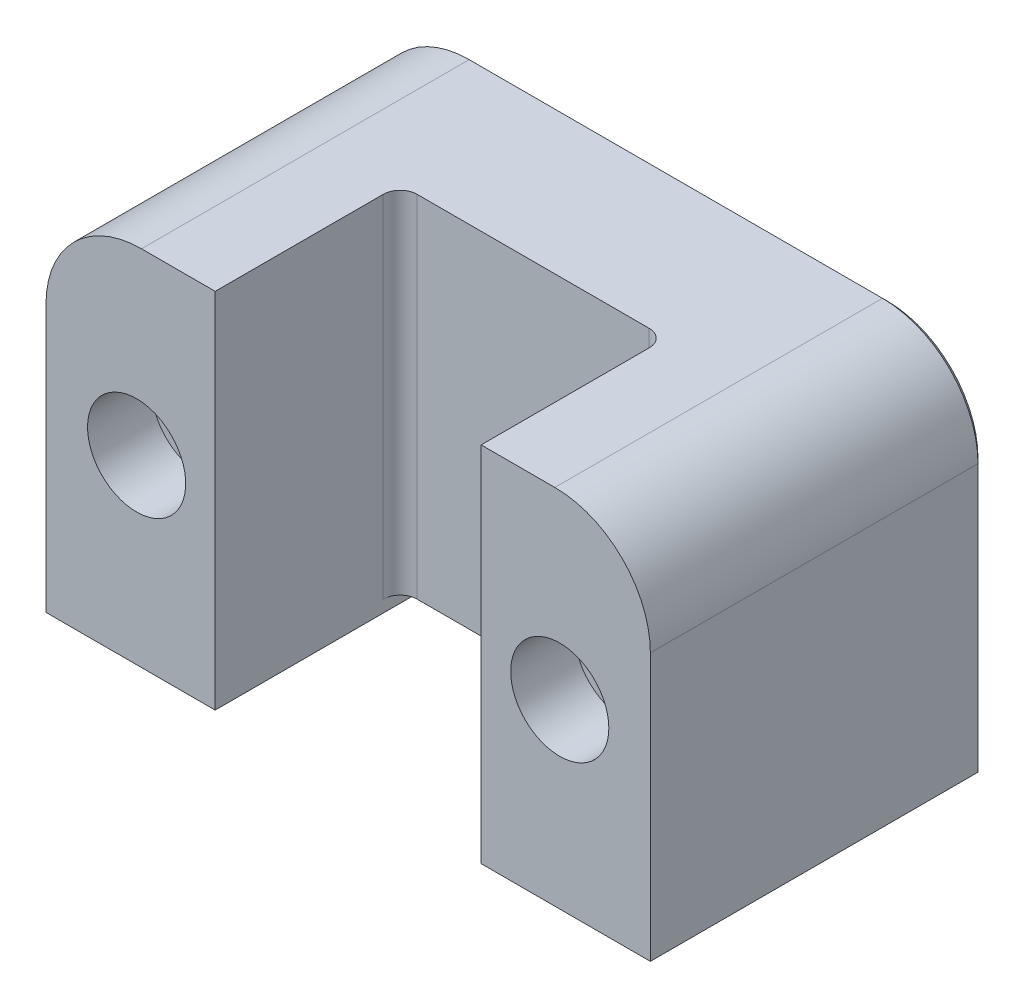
ISO-10303-21;
HEADER;
FILE_DESCRIPTION(('STEP AP214'),'2;1');
FILE_NAME('part.step','',(''),(''),'','','');
FILE_SCHEMA(('AUTOMOTIVE_DESIGN { 1 0 10303 214 1 1 1 1 }'));
ENDSEC;
DATA;
#1=APPLICATION_CONTEXT('core data for automotive mechanical design processes');
#2=APPLICATION_PROTOCOL_DEFINITION('international standard','automotive_design',2000,#1);
#3=PRODUCT_CONTEXT('',#1,'mechanical');
#4=PRODUCT('Part','Part','',(#3));
#5=PRODUCT_RELATED_PRODUCT_CATEGORY('part','',(#4));
#6=PRODUCT_DEFINITION_FORMATION('','',#4);
#7=PRODUCT_DEFINITION_CONTEXT('part definition',#1,'design');
#8=PRODUCT_DEFINITION('design','',#6,#7);
#9=PRODUCT_DEFINITION_SHAPE('','',#8);
#10=(LENGTH_UNIT() NAMED_UNIT(*) SI_UNIT(.MILLI.,.METRE.));
#11=(NAMED_UNIT(*) PLANE_ANGLE_UNIT() SI_UNIT($,.RADIAN.));
#12=(NAMED_UNIT(*) SI_UNIT($,.STERADIAN.) SOLID_ANGLE_UNIT());
#13=UNCERTAINTY_MEASURE_WITH_UNIT(LENGTH_MEASURE(1.E-05),#10,'distance_accuracy_value','');
#14=(GEOMETRIC_REPRESENTATION_CONTEXT(3) GLOBAL_UNCERTAINTY_ASSIGNED_CONTEXT((#13)) GLOBAL_UNIT_ASSIGNED_CONTEXT((#10,
#11,#12)) REPRESENTATION_CONTEXT('',''));
#15=CARTESIAN_POINT('',(0.,0.,0.));
#16=DIRECTION('',(0.,0.,1.));
#17=DIRECTION('',(1.,0.,0.));
#18=AXIS2_PLACEMENT_3D('',#15,#16,#17);
#19=CARTESIAN_POINT('',(-31.74365,38.1,-34.925));
#20=DIRECTION('',(0.,0.,1.));
#21=DIRECTION('',(1.,0.,0.));
#22=AXIS2_PLACEMENT_3D('',#19,#20,#21);
#23=PLANE('',#22);
#24=CARTESIAN_POINT('',(-22.225,19.05,-34.925));
#25=DIRECTION('',(0.,0.,-1.));
#26=DIRECTION('',(-1.,0.,0.));
#27=AXIS2_PLACEMENT_3D('',#24,#25,#26);
#28=CIRCLE('',#27,3.56870000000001);
#29=CARTESIAN_POINT('',(-25.7937,19.05,-34.925));
#30=VERTEX_POINT('',#29);
#31=EDGE_CURVE('E322',#30,#30,#28,.T.);
#32=ORIENTED_EDGE('',*,*,#31,.F.);
#33=EDGE_LOOP('',(#32));
#34=FACE_BOUND('',#33,.T.);
#35=CARTESIAN_POINT('',(21.71065,28.067,-34.925));
#36=DIRECTION('',(0.,0.,1.));
#37=DIRECTION('',(1.,0.,0.));
#38=AXIS2_PLACEMENT_3D('',#35,#36,#37);
#39=CIRCLE('',#38,9.52499999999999);
#40=CARTESIAN_POINT('',(21.71065,37.592,-34.925));
#41=VERTEX_POINT('',#40);
#42=CARTESIAN_POINT('',(31.23565,28.067,-34.925));
#43=VERTEX_POINT('',#42);
#44=EDGE_CURVE('E275',#41,#43,#39,.F.);
#45=ORIENTED_EDGE('',*,*,#44,.T.);
#46=DIRECTION('',(0.,-1.,0.));
#47=VECTOR('',#46,1.);
#48=CARTESIAN_POINT('',(31.23565,38.1,-34.925));
#49=LINE('',#48,#47);
#50=CARTESIAN_POINT('',(31.23565,0.,-34.925));
#51=VERTEX_POINT('',#50);
#52=EDGE_CURVE('E279',#43,#51,#49,.T.);
#53=ORIENTED_EDGE('',*,*,#52,.T.);
#54=DIRECTION('',(-1.,0.,0.));
#55=VECTOR('',#54,1.);
#56=CARTESIAN_POINT('',(-31.74365,0.,-34.925));
#57=LINE('',#56,#55);
#58=CARTESIAN_POINT('',(-31.23565,0.,-34.925));
#59=VERTEX_POINT('',#58);
#60=EDGE_CURVE('E173',#51,#59,#57,.T.);
#61=ORIENTED_EDGE('',*,*,#60,.T.);
#62=DIRECTION('',(0.,1.,0.));
#63=VECTOR('',#62,1.);
#64=CARTESIAN_POINT('',(-31.23565,38.1,-34.925));
#65=LINE('',#64,#63);
#66=CARTESIAN_POINT('',(-31.23565,28.067,-34.925));
#67=VERTEX_POINT('',#66);
#68=EDGE_CURVE('E277',#59,#67,#65,.T.);
#69=ORIENTED_EDGE('',*,*,#68,.T.);
#70=CARTESIAN_POINT('',(-21.71065,28.067,-34.925));
#71=DIRECTION('',(0.,0.,1.));
#72=DIRECTION('',(1.,0.,0.));
#73=AXIS2_PLACEMENT_3D('',#70,#71,#72);
#74=CIRCLE('',#73,9.52499999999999);
#75=CARTESIAN_POINT('',(-21.71065,37.592,-34.925));
#76=VERTEX_POINT('',#75);
#77=EDGE_CURVE('E273',#67,#76,#74,.F.);
#78=ORIENTED_EDGE('',*,*,#77,.T.);
#79=DIRECTION('',(1.,0.,0.));
#80=VECTOR('',#79,1.);
#81=CARTESIAN_POINT('',(-31.74365,37.592,-34.925));
#82=LINE('',#81,#80);
#83=EDGE_CURVE('E271',#76,#41,#82,.T.);
#84=ORIENTED_EDGE('',*,*,#83,.T.);
#85=EDGE_LOOP('',(#45,#53,#61,#69,#78,#84));
#86=FACE_BOUND('',#85,.T.);
#87=CARTESIAN_POINT('',(22.225,19.05,-34.925));
#88=DIRECTION('',(0.,0.,1.));
#89=DIRECTION('',(1.,0.,0.));
#90=AXIS2_PLACEMENT_3D('',#87,#88,#89);
#91=CIRCLE('',#90,3.56870000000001);
#92=CARTESIAN_POINT('',(25.7937,19.05,-34.925));
#93=VERTEX_POINT('',#92);
#94=EDGE_CURVE('E303',#93,#93,#91,.T.);
#95=ORIENTED_EDGE('',*,*,#94,.T.);
#96=EDGE_LOOP('',(#95));
#97=FACE_BOUND('',#96,.T.);
#98=ADVANCED_FACE('F32',(#34,#86,#97),#23,.F.);
#99=CARTESIAN_POINT('',(13.97,38.1,0.));
#100=DIRECTION('',(0.,0.,-1.));
#101=DIRECTION('',(-1.,0.,0.));
#102=AXIS2_PLACEMENT_3D('',#99,#100,#101);
#103=PLANE('',#102);
#104=DIRECTION('',(0.,-1.,0.));
#105=VECTOR('',#104,1.);
#106=CARTESIAN_POINT('',(31.74365,38.1,0.));
#107=LINE('',#106,#105);
#108=CARTESIAN_POINT('',(31.74365,28.067,0.));
#109=VERTEX_POINT('',#108);
#110=CARTESIAN_POINT('',(31.74365,0.,0.));
#111=VERTEX_POINT('',#110);
#112=EDGE_CURVE('E202',#109,#111,#107,.T.);
#113=ORIENTED_EDGE('',*,*,#112,.F.);
#114=CARTESIAN_POINT('',(21.71065,28.067,0.));
#115=DIRECTION('',(0.,0.,-1.));
#116=DIRECTION('',(-1.,0.,0.));
#117=AXIS2_PLACEMENT_3D('',#114,#115,#116);
#118=CIRCLE('',#117,10.033);
#119=CARTESIAN_POINT('',(21.71065,38.1,0.));
#120=VERTEX_POINT('',#119);
#121=EDGE_CURVE('E264',#109,#120,#118,.F.);
#122=ORIENTED_EDGE('',*,*,#121,.T.);
#123=DIRECTION('',(1.,0.,0.));
#124=VECTOR('',#123,1.);
#125=CARTESIAN_POINT('',(13.97,38.1,0.));
#126=LINE('',#125,#124);
#127=CARTESIAN_POINT('',(13.97,38.1,0.));
#128=VERTEX_POINT('',#127);
#129=EDGE_CURVE('E199',#128,#120,#126,.T.);
#130=ORIENTED_EDGE('',*,*,#129,.F.);
#131=DIRECTION('',(0.,-1.,0.));
#132=VECTOR('',#131,1.);
#133=CARTESIAN_POINT('',(13.97,38.1,0.));
#134=LINE('',#133,#132);
#135=CARTESIAN_POINT('',(13.97,0.,0.));
#136=VERTEX_POINT('',#135);
#137=EDGE_CURVE('E186',#128,#136,#134,.T.);
#138=ORIENTED_EDGE('',*,*,#137,.T.);
#139=DIRECTION('',(1.,0.,0.));
#140=VECTOR('',#139,1.);
#141=CARTESIAN_POINT('',(13.97,0.,0.));
#142=LINE('',#141,#140);
#143=EDGE_CURVE('E211',#136,#111,#142,.T.);
#144=ORIENTED_EDGE('',*,*,#143,.T.);
#145=EDGE_LOOP('',(#113,#122,#130,#138,#144));
#146=FACE_BOUND('',#145,.T.);
#147=CARTESIAN_POINT('',(22.225,19.05,0.));
#148=DIRECTION('',(0.,0.,1.));
#149=DIRECTION('',(1.,0.,0.));
#150=AXIS2_PLACEMENT_3D('',#147,#148,#149);
#151=CIRCLE('',#150,5.1562);
#152=CARTESIAN_POINT('',(27.3812,19.05,0.));
#153=VERTEX_POINT('',#152);
#154=EDGE_CURVE('E319',#153,#153,#151,.T.);
#155=ORIENTED_EDGE('',*,*,#154,.F.);
#156=EDGE_LOOP('',(#155));
#157=FACE_BOUND('',#156,.T.);
#158=ADVANCED_FACE('F367',(#146,#157),#103,.F.);
#159=CARTESIAN_POINT('',(-31.74365,38.1,0.));
#160=DIRECTION('',(0.,0.,-1.));
#161=DIRECTION('',(-1.,0.,0.));
#162=AXIS2_PLACEMENT_3D('',#159,#160,#161);
#163=PLANE('',#162);
#164=DIRECTION('',(1.,0.,0.));
#165=VECTOR('',#164,1.);
#166=CARTESIAN_POINT('',(-31.74365,38.1,0.));
#167=LINE('',#166,#165);
#168=CARTESIAN_POINT('',(-21.71065,38.1,0.));
#169=VERTEX_POINT('',#168);
#170=CARTESIAN_POINT('',(-13.97,38.1,0.));
#171=VERTEX_POINT('',#170);
#172=EDGE_CURVE('E164',#169,#171,#167,.T.);
#173=ORIENTED_EDGE('',*,*,#172,.F.);
#174=CARTESIAN_POINT('',(-21.71065,28.067,0.));
#175=DIRECTION('',(0.,0.,-1.));
#176=DIRECTION('',(-1.,0.,0.));
#177=AXIS2_PLACEMENT_3D('',#174,#175,#176);
#178=CIRCLE('',#177,10.033);
#179=CARTESIAN_POINT('',(-31.74365,28.067,0.));
#180=VERTEX_POINT('',#179);
#181=EDGE_CURVE('E266',#169,#180,#178,.F.);
#182=ORIENTED_EDGE('',*,*,#181,.T.);
#183=DIRECTION('',(0.,-1.,0.));
#184=VECTOR('',#183,1.);
#185=CARTESIAN_POINT('',(-31.74365,38.1,0.));
#186=LINE('',#185,#184);
#187=CARTESIAN_POINT('',(-31.74365,0.,0.));
#188=VERTEX_POINT('',#187);
#189=EDGE_CURVE('E185',#180,#188,#186,.T.);
#190=ORIENTED_EDGE('',*,*,#189,.T.);
#191=DIRECTION('',(1.,0.,0.));
#192=VECTOR('',#191,1.);
#193=CARTESIAN_POINT('',(-31.74365,0.,0.));
#194=LINE('',#193,#192);
#195=CARTESIAN_POINT('',(-13.97,0.,0.));
#196=VERTEX_POINT('',#195);
#197=EDGE_CURVE('E181',#188,#196,#194,.T.);
#198=ORIENTED_EDGE('',*,*,#197,.T.);
#199=DIRECTION('',(0.,-1.,0.));
#200=VECTOR('',#199,1.);
#201=CARTESIAN_POINT('',(-13.97,38.1,0.));
#202=LINE('',#201,#200);
#203=EDGE_CURVE('E176',#171,#196,#202,.T.);
#204=ORIENTED_EDGE('',*,*,#203,.F.);
#205=EDGE_LOOP('',(#173,#182,#190,#198,#204));
#206=FACE_BOUND('',#205,.T.);
#207=CARTESIAN_POINT('',(-22.225,19.05,0.));
#208=DIRECTION('',(0.,0.,-1.));
#209=DIRECTION('',(-1.,0.,0.));
#210=AXIS2_PLACEMENT_3D('',#207,#208,#209);
#211=CIRCLE('',#210,5.1562);
#212=CARTESIAN_POINT('',(-27.3812,19.05,0.));
#213=VERTEX_POINT('',#212);
#214=EDGE_CURVE('E331',#213,#213,#211,.T.);
#215=ORIENTED_EDGE('',*,*,#214,.T.);
#216=EDGE_LOOP('',(#215));
#217=FACE_BOUND('',#216,.T.);
#218=ADVANCED_FACE('F177',(#206,#217),#163,.F.);
#219=CARTESIAN_POINT('',(-31.74365,38.1,0.));
#220=DIRECTION('',(1.,0.,0.));
#221=DIRECTION('',(0.,0.,-1.));
#222=AXIS2_PLACEMENT_3D('',#219,#220,#221);
#223=PLANE('',#222);
#224=DIRECTION('',(0.,0.,1.));
#225=VECTOR('',#224,1.);
#226=CARTESIAN_POINT('',(-31.74365,28.067,0.));
#227=LINE('',#226,#225);
#228=CARTESIAN_POINT('',(-31.74365,28.067,-34.417));
#229=VERTEX_POINT('',#228);
#230=EDGE_CURVE('E268',#180,#229,#227,.F.);
#231=ORIENTED_EDGE('',*,*,#230,.T.);
#232=DIRECTION('',(0.,-1.,0.));
#233=VECTOR('',#232,1.);
#234=CARTESIAN_POINT('',(-31.74365,38.1,-34.417));
#235=LINE('',#234,#233);
#236=CARTESIAN_POINT('',(-31.74365,0.,-34.417));
#237=VERTEX_POINT('',#236);
#238=EDGE_CURVE('E288',#229,#237,#235,.T.);
#239=ORIENTED_EDGE('',*,*,#238,.T.);
#240=DIRECTION('',(0.,0.,1.));
#241=VECTOR('',#240,1.);
#242=CARTESIAN_POINT('',(-31.74365,0.,0.));
#243=LINE('',#242,#241);
#244=EDGE_CURVE('E203',#237,#188,#243,.T.);
#245=ORIENTED_EDGE('',*,*,#244,.T.);
#246=ORIENTED_EDGE('',*,*,#189,.F.);
#247=EDGE_LOOP('',(#231,#239,#245,#246));
#248=FACE_BOUND('',#247,.T.);
#249=ADVANCED_FACE('F420',(#248),#223,.F.);
#250=CARTESIAN_POINT('',(-13.97,38.1,0.));
#251=DIRECTION('',(-1.,0.,0.));
#252=DIRECTION('',(0.,0.,1.));
#253=AXIS2_PLACEMENT_3D('',#250,#251,#252);
#254=PLANE('',#253);
#255=DIRECTION('',(0.,0.,-1.));
#256=VECTOR('',#255,1.);
#257=CARTESIAN_POINT('',(-13.97,1.27,-25.781));
#258=LINE('',#257,#256);
#259=CARTESIAN_POINT('',(-13.97,1.27,-17.653));
#260=VERTEX_POINT('',#259);
#261=CARTESIAN_POINT('',(-13.97,1.27,-23.749));
#262=VERTEX_POINT('',#261);
#263=EDGE_CURVE('E335',#260,#262,#258,.T.);
#264=ORIENTED_EDGE('',*,*,#263,.F.);
#265=DIRECTION('',(0.,-1.,0.));
#266=VECTOR('',#265,1.);
#267=CARTESIAN_POINT('',(-13.97,38.1,-17.653));
#268=LINE('',#267,#266);
#269=CARTESIAN_POINT('',(-13.97,38.1,-17.653));
#270=VERTEX_POINT('',#269);
#271=EDGE_CURVE('E190',#260,#270,#268,.F.);
#272=ORIENTED_EDGE('',*,*,#271,.T.);
#273=DIRECTION('',(0.,0.,-1.));
#274=VECTOR('',#273,1.);
#275=CARTESIAN_POINT('',(-13.97,38.1,0.));
#276=LINE('',#275,#274);
#277=EDGE_CURVE('E168',#171,#270,#276,.T.);
#278=ORIENTED_EDGE('',*,*,#277,.F.);
#279=ORIENTED_EDGE('',*,*,#203,.T.);
#280=DIRECTION('',(0.,0.,-1.));
#281=VECTOR('',#280,1.);
#282=CARTESIAN_POINT('',(-13.97,0.,0.));
#283=LINE('',#282,#281);
#284=CARTESIAN_POINT('',(-13.97,0.,-23.749));
#285=VERTEX_POINT('',#284);
#286=EDGE_CURVE('E207',#196,#285,#283,.T.);
#287=ORIENTED_EDGE('',*,*,#286,.T.);
#288=DIRECTION('',(0.,-1.,0.));
#289=VECTOR('',#288,1.);
#290=CARTESIAN_POINT('',(-13.97,1.27,-23.749));
#291=LINE('',#290,#289);
#292=EDGE_CURVE('E235',#285,#262,#291,.F.);
#293=ORIENTED_EDGE('',*,*,#292,.T.);
#294=EDGE_LOOP('',(#264,#272,#278,#279,#287,#293));
#295=FACE_BOUND('',#294,.T.);
#296=ADVANCED_FACE('F188',(#295),#254,.F.);
#297=CARTESIAN_POINT('',(-13.97,38.1,-19.431));
#298=DIRECTION('',(0.,0.,-1.));
#299=DIRECTION('',(-1.,0.,0.));
#300=AXIS2_PLACEMENT_3D('',#297,#298,#299);
#301=PLANE('',#300);
#302=DIRECTION('',(1.,0.,0.));
#303=VECTOR('',#302,1.);
#304=CARTESIAN_POINT('',(-13.97,1.27,-19.431));
#305=LINE('',#304,#303);
#306=CARTESIAN_POINT('',(-12.192,1.27,-19.431));
#307=VERTEX_POINT('',#306);
#308=CARTESIAN_POINT('',(12.192,1.27,-19.431));
#309=VERTEX_POINT('',#308);
#310=EDGE_CURVE('E205',#307,#309,#305,.T.);
#311=ORIENTED_EDGE('',*,*,#310,.T.);
#312=DIRECTION('',(0.,-1.,0.));
#313=VECTOR('',#312,1.);
#314=CARTESIAN_POINT('',(12.192,38.1,-19.431));
#315=LINE('',#314,#313);
#316=CARTESIAN_POINT('',(12.192,38.1,-19.431));
#317=VERTEX_POINT('',#316);
#318=EDGE_CURVE('E247',#309,#317,#315,.F.);
#319=ORIENTED_EDGE('',*,*,#318,.T.);
#320=DIRECTION('',(1.,0.,0.));
#321=VECTOR('',#320,1.);
#322=CARTESIAN_POINT('',(-13.97,38.1,-19.431));
#323=LINE('',#322,#321);
#324=CARTESIAN_POINT('',(-12.192,38.1,-19.431));
#325=VERTEX_POINT('',#324);
#326=EDGE_CURVE('E191',#325,#317,#323,.T.);
#327=ORIENTED_EDGE('',*,*,#326,.F.);
#328=DIRECTION('',(0.,-1.,0.));
#329=VECTOR('',#328,1.);
#330=CARTESIAN_POINT('',(-12.192,1.27,-19.431));
#331=LINE('',#330,#329);
#332=EDGE_CURVE('E244',#325,#307,#331,.T.);
#333=ORIENTED_EDGE('',*,*,#332,.T.);
#334=EDGE_LOOP('',(#311,#319,#327,#333));
#335=FACE_BOUND('',#334,.T.);
#336=ADVANCED_FACE('F348',(#335),#301,.F.);
#337=CARTESIAN_POINT('',(13.97,38.1,0.));
#338=DIRECTION('',(1.,0.,0.));
#339=DIRECTION('',(0.,0.,-1.));
#340=AXIS2_PLACEMENT_3D('',#337,#338,#339);
#341=PLANE('',#340);
#342=DIRECTION('',(0.,0.,1.));
#343=VECTOR('',#342,1.);
#344=CARTESIAN_POINT('',(13.97,38.1,0.));
#345=LINE('',#344,#343);
#346=CARTESIAN_POINT('',(13.97,38.1,-17.653));
#347=VERTEX_POINT('',#346);
#348=EDGE_CURVE('E194',#347,#128,#345,.T.);
#349=ORIENTED_EDGE('',*,*,#348,.F.);
#350=DIRECTION('',(0.,-1.,0.));
#351=VECTOR('',#350,1.);
#352=CARTESIAN_POINT('',(13.97,1.27,-17.653));
#353=LINE('',#352,#351);
#354=CARTESIAN_POINT('',(13.97,1.27,-17.653));
#355=VERTEX_POINT('',#354);
#356=EDGE_CURVE('E241',#347,#355,#353,.T.);
#357=ORIENTED_EDGE('',*,*,#356,.T.);
#358=DIRECTION('',(0.,0.,1.));
#359=VECTOR('',#358,1.);
#360=CARTESIAN_POINT('',(13.97,1.27,-25.781));
#361=LINE('',#360,#359);
#362=CARTESIAN_POINT('',(13.97,1.27,-23.749));
#363=VERTEX_POINT('',#362);
#364=EDGE_CURVE('E341',#363,#355,#361,.T.);
#365=ORIENTED_EDGE('',*,*,#364,.F.);
#366=DIRECTION('',(0.,-1.,0.));
#367=VECTOR('',#366,1.);
#368=CARTESIAN_POINT('',(13.97,0.,-23.749));
#369=LINE('',#368,#367);
#370=CARTESIAN_POINT('',(13.97,0.,-23.749));
#371=VERTEX_POINT('',#370);
#372=EDGE_CURVE('E223',#363,#371,#369,.T.);
#373=ORIENTED_EDGE('',*,*,#372,.T.);
#374=DIRECTION('',(0.,0.,1.));
#375=VECTOR('',#374,1.);
#376=CARTESIAN_POINT('',(13.97,0.,0.));
#377=LINE('',#376,#375);
#378=EDGE_CURVE('E209',#371,#136,#377,.T.);
#379=ORIENTED_EDGE('',*,*,#378,.T.);
#380=ORIENTED_EDGE('',*,*,#137,.F.);
#381=EDGE_LOOP('',(#349,#357,#365,#373,#379,#380));
#382=FACE_BOUND('',#381,.T.);
#383=ADVANCED_FACE('F360',(#382),#341,.F.);
#384=CARTESIAN_POINT('',(31.74365,38.1,0.));
#385=DIRECTION('',(-1.,0.,0.));
#386=DIRECTION('',(0.,0.,1.));
#387=AXIS2_PLACEMENT_3D('',#384,#385,#386);
#388=PLANE('',#387);
#389=DIRECTION('',(0.,0.,-1.));
#390=VECTOR('',#389,1.);
#391=CARTESIAN_POINT('',(31.74365,0.,0.));
#392=LINE('',#391,#390);
#393=CARTESIAN_POINT('',(31.74365,0.,-34.417));
#394=VERTEX_POINT('',#393);
#395=EDGE_CURVE('E214',#111,#394,#392,.T.);
#396=ORIENTED_EDGE('',*,*,#395,.T.);
#397=DIRECTION('',(0.,1.,0.));
#398=VECTOR('',#397,1.);
#399=CARTESIAN_POINT('',(31.74365,38.1,-34.417));
#400=LINE('',#399,#398);
#401=CARTESIAN_POINT('',(31.74365,28.067,-34.417));
#402=VERTEX_POINT('',#401);
#403=EDGE_CURVE('E286',#394,#402,#400,.T.);
#404=ORIENTED_EDGE('',*,*,#403,.T.);
#405=DIRECTION('',(0.,0.,-1.));
#406=VECTOR('',#405,1.);
#407=CARTESIAN_POINT('',(31.74365,28.067,0.));
#408=LINE('',#407,#406);
#409=EDGE_CURVE('E262',#402,#109,#408,.F.);
#410=ORIENTED_EDGE('',*,*,#409,.T.);
#411=ORIENTED_EDGE('',*,*,#112,.T.);
#412=EDGE_LOOP('',(#396,#404,#410,#411));
#413=FACE_BOUND('',#412,.T.);
#414=ADVANCED_FACE('F411',(#413),#388,.F.);
#415=CARTESIAN_POINT('',(-31.74365,38.1,-34.925));
#416=DIRECTION('',(0.,-1.,0.));
#417=DIRECTION('',(0.,0.,-1.));
#418=AXIS2_PLACEMENT_3D('',#415,#416,#417);
#419=PLANE('',#418);
#420=DIRECTION('',(0.,0.,-1.));
#421=VECTOR('',#420,1.);
#422=CARTESIAN_POINT('',(21.71065,38.1,-34.925));
#423=LINE('',#422,#421);
#424=CARTESIAN_POINT('',(21.71065,38.1,-34.417));
#425=VERTEX_POINT('',#424);
#426=EDGE_CURVE('E260',#120,#425,#423,.T.);
#427=ORIENTED_EDGE('',*,*,#426,.T.);
#428=DIRECTION('',(-1.,0.,0.));
#429=VECTOR('',#428,1.);
#430=CARTESIAN_POINT('',(-31.74365,38.1,-34.417));
#431=LINE('',#430,#429);
#432=CARTESIAN_POINT('',(-21.71065,38.1,-34.417));
#433=VERTEX_POINT('',#432);
#434=EDGE_CURVE('E11',#425,#433,#431,.T.);
#435=ORIENTED_EDGE('',*,*,#434,.T.);
#436=DIRECTION('',(0.,0.,1.));
#437=VECTOR('',#436,1.);
#438=CARTESIAN_POINT('',(-21.71065,38.1,-34.925));
#439=LINE('',#438,#437);
#440=EDGE_CURVE('E170',#433,#169,#439,.T.);
#441=ORIENTED_EDGE('',*,*,#440,.T.);
#442=ORIENTED_EDGE('',*,*,#172,.T.);
#443=ORIENTED_EDGE('',*,*,#277,.T.);
#444=CARTESIAN_POINT('',(-12.192,38.1,-17.653));
#445=DIRECTION('',(0.,-1.,0.));
#446=DIRECTION('',(0.,0.,-1.));
#447=AXIS2_PLACEMENT_3D('',#444,#445,#446);
#448=CIRCLE('',#447,1.778);
#449=EDGE_CURVE('E257',#270,#325,#448,.T.);
#450=ORIENTED_EDGE('',*,*,#449,.T.);
#451=ORIENTED_EDGE('',*,*,#326,.T.);
#452=CARTESIAN_POINT('',(12.192,38.1,-17.653));
#453=DIRECTION('',(0.,-1.,0.));
#454=DIRECTION('',(0.,0.,-1.));
#455=AXIS2_PLACEMENT_3D('',#452,#453,#454);
#456=CIRCLE('',#455,1.778);
#457=EDGE_CURVE('E252',#317,#347,#456,.T.);
#458=ORIENTED_EDGE('',*,*,#457,.T.);
#459=ORIENTED_EDGE('',*,*,#348,.T.);
#460=ORIENTED_EDGE('',*,*,#129,.T.);
#461=EDGE_LOOP('',(#427,#435,#441,#442,#443,#450,#451,#458,#459,#460));
#462=FACE_BOUND('',#461,.T.);
#463=ADVANCED_FACE('F166',(#462),#419,.F.);
#464=CARTESIAN_POINT('',(-31.74365,0.,-34.925));
#465=DIRECTION('',(0.,-1.,0.));
#466=DIRECTION('',(0.,0.,-1.));
#467=AXIS2_PLACEMENT_3D('',#464,#465,#466);
#468=PLANE('',#467);
#469=ORIENTED_EDGE('',*,*,#60,.F.);
#470=DIRECTION('',(-0.707106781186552,0.,-0.707106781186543));
#471=VECTOR('',#470,1.);
#472=CARTESIAN_POINT('',(-0.254000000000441,0.,-66.41465));
#473=LINE('',#472,#471);
#474=EDGE_CURVE('E284',#51,#394,#473,.F.);
#475=ORIENTED_EDGE('',*,*,#474,.T.);
#476=ORIENTED_EDGE('',*,*,#395,.F.);
#477=ORIENTED_EDGE('',*,*,#143,.F.);
#478=ORIENTED_EDGE('',*,*,#378,.F.);
#479=CARTESIAN_POINT('',(11.938,0.,-23.749));
#480=DIRECTION('',(0.,-1.,0.));
#481=DIRECTION('',(0.,0.,-1.));
#482=AXIS2_PLACEMENT_3D('',#479,#480,#481);
#483=CIRCLE('',#482,2.032);
#484=CARTESIAN_POINT('',(11.938,0.,-25.781));
#485=VERTEX_POINT('',#484);
#486=EDGE_CURVE('E237',#371,#485,#483,.F.);
#487=ORIENTED_EDGE('',*,*,#486,.T.);
#488=DIRECTION('',(1.,0.,0.));
#489=VECTOR('',#488,1.);
#490=CARTESIAN_POINT('',(-13.97,0.,-25.781));
#491=LINE('',#490,#489);
#492=CARTESIAN_POINT('',(-11.938,0.,-25.781));
#493=VERTEX_POINT('',#492);
#494=EDGE_CURVE('E334',#493,#485,#491,.T.);
#495=ORIENTED_EDGE('',*,*,#494,.F.);
#496=CARTESIAN_POINT('',(-11.938,0.,-23.749));
#497=DIRECTION('',(0.,-1.,0.));
#498=DIRECTION('',(0.,0.,-1.));
#499=AXIS2_PLACEMENT_3D('',#496,#497,#498);
#500=CIRCLE('',#499,2.032);
#501=EDGE_CURVE('E239',#493,#285,#500,.F.);
#502=ORIENTED_EDGE('',*,*,#501,.T.);
#503=ORIENTED_EDGE('',*,*,#286,.F.);
#504=ORIENTED_EDGE('',*,*,#197,.F.);
#505=ORIENTED_EDGE('',*,*,#244,.F.);
#506=DIRECTION('',(-0.707106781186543,0.,0.707106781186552));
#507=VECTOR('',#506,1.);
#508=CARTESIAN_POINT('',(-31.48965,0.,-34.671));
#509=LINE('',#508,#507);
#510=EDGE_CURVE('E282',#237,#59,#509,.F.);
#511=ORIENTED_EDGE('',*,*,#510,.T.);
#512=EDGE_LOOP('',(#469,#475,#476,#477,#478,#487,#495,#502,#503,#504,#505,#511));
#513=FACE_BOUND('',#512,.T.);
#514=ADVANCED_FACE('F385',(#513),#468,.T.);
#515=CARTESIAN_POINT('',(-13.97,1.27,-14.0108747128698));
#516=DIRECTION('',(0.,1.,0.));
#517=DIRECTION('',(0.,0.,1.));
#518=AXIS2_PLACEMENT_3D('',#515,#516,#517);
#519=PLANE('',#518);
#520=DIRECTION('',(1.,0.,0.));
#521=VECTOR('',#520,1.);
#522=CARTESIAN_POINT('',(-13.97,1.27,-25.781));
#523=LINE('',#522,#521);
#524=CARTESIAN_POINT('',(-11.938,1.27,-25.781));
#525=VERTEX_POINT('',#524);
#526=CARTESIAN_POINT('',(11.938,1.27,-25.781));
#527=VERTEX_POINT('',#526);
#528=EDGE_CURVE('E338',#525,#527,#523,.T.);
#529=ORIENTED_EDGE('',*,*,#528,.T.);
#530=CARTESIAN_POINT('',(11.938,1.27,-23.749));
#531=DIRECTION('',(0.,1.,0.));
#532=DIRECTION('',(0.,0.,1.));
#533=AXIS2_PLACEMENT_3D('',#530,#531,#532);
#534=CIRCLE('',#533,2.032);
#535=EDGE_CURVE('E233',#527,#363,#534,.F.);
#536=ORIENTED_EDGE('',*,*,#535,.T.);
#537=ORIENTED_EDGE('',*,*,#364,.T.);
#538=CARTESIAN_POINT('',(12.192,1.27,-17.653));
#539=DIRECTION('',(0.,1.,0.));
#540=DIRECTION('',(0.,0.,1.));
#541=AXIS2_PLACEMENT_3D('',#538,#539,#540);
#542=CIRCLE('',#541,1.778);
#543=EDGE_CURVE('E250',#355,#309,#542,.T.);
#544=ORIENTED_EDGE('',*,*,#543,.T.);
#545=ORIENTED_EDGE('',*,*,#310,.F.);
#546=CARTESIAN_POINT('',(-12.192,1.27,-17.653));
#547=DIRECTION('',(0.,1.,0.));
#548=DIRECTION('',(0.,0.,1.));
#549=AXIS2_PLACEMENT_3D('',#546,#547,#548);
#550=CIRCLE('',#549,1.778);
#551=EDGE_CURVE('E254',#307,#260,#550,.T.);
#552=ORIENTED_EDGE('',*,*,#551,.T.);
#553=ORIENTED_EDGE('',*,*,#263,.T.);
#554=CARTESIAN_POINT('',(-11.938,1.27,-23.749));
#555=DIRECTION('',(0.,1.,0.));
#556=DIRECTION('',(0.,0.,1.));
#557=AXIS2_PLACEMENT_3D('',#554,#555,#556);
#558=CIRCLE('',#557,2.032);
#559=EDGE_CURVE('E231',#262,#525,#558,.F.);
#560=ORIENTED_EDGE('',*,*,#559,.T.);
#561=EDGE_LOOP('',(#529,#536,#537,#544,#545,#552,#553,#560));
#562=FACE_BOUND('',#561,.T.);
#563=ADVANCED_FACE('F496',(#562),#519,.F.);
#564=CARTESIAN_POINT('',(-13.97,1.27,-25.781));
#565=DIRECTION('',(0.,0.,-1.));
#566=DIRECTION('',(-1.,0.,0.));
#567=AXIS2_PLACEMENT_3D('',#564,#565,#566);
#568=PLANE('',#567);
#569=ORIENTED_EDGE('',*,*,#494,.T.);
#570=DIRECTION('',(0.,-1.,0.));
#571=VECTOR('',#570,1.);
#572=CARTESIAN_POINT('',(11.938,1.27,-25.781));
#573=LINE('',#572,#571);
#574=EDGE_CURVE('E229',#485,#527,#573,.F.);
#575=ORIENTED_EDGE('',*,*,#574,.T.);
#576=ORIENTED_EDGE('',*,*,#528,.F.);
#577=DIRECTION('',(0.,-1.,0.));
#578=VECTOR('',#577,1.);
#579=CARTESIAN_POINT('',(-11.938,0.,-25.781));
#580=LINE('',#579,#578);
#581=EDGE_CURVE('E226',#525,#493,#580,.T.);
#582=ORIENTED_EDGE('',*,*,#581,.T.);
#583=EDGE_LOOP('',(#569,#575,#576,#582));
#584=FACE_BOUND('',#583,.T.);
#585=ADVANCED_FACE('F430',(#584),#568,.F.);
#586=CARTESIAN_POINT('',(11.938,38.1,-23.749));
#587=DIRECTION('',(0.,1.,0.));
#588=DIRECTION('',(0.,0.,1.));
#589=AXIS2_PLACEMENT_3D('',#586,#587,#588);
#590=CYLINDRICAL_SURFACE('',#589,2.032);
#591=ORIENTED_EDGE('',*,*,#535,.F.);
#592=ORIENTED_EDGE('',*,*,#574,.F.);
#593=ORIENTED_EDGE('',*,*,#486,.F.);
#594=ORIENTED_EDGE('',*,*,#372,.F.);
#595=EDGE_LOOP('',(#591,#592,#593,#594));
#596=FACE_BOUND('',#595,.T.);
#597=ADVANCED_FACE('F426',(#596),#590,.F.);
#598=CARTESIAN_POINT('',(-11.938,1.27,-23.749));
#599=DIRECTION('',(0.,1.,0.));
#600=DIRECTION('',(0.,0.,1.));
#601=AXIS2_PLACEMENT_3D('',#598,#599,#600);
#602=CYLINDRICAL_SURFACE('',#601,2.032);
#603=ORIENTED_EDGE('',*,*,#559,.F.);
#604=ORIENTED_EDGE('',*,*,#292,.F.);
#605=ORIENTED_EDGE('',*,*,#501,.F.);
#606=ORIENTED_EDGE('',*,*,#581,.F.);
#607=EDGE_LOOP('',(#603,#604,#605,#606));
#608=FACE_BOUND('',#607,.T.);
#609=ADVANCED_FACE('F429',(#608),#602,.F.);
#610=CARTESIAN_POINT('',(12.192,38.1,-17.653));
#611=DIRECTION('',(0.,1.,0.));
#612=DIRECTION('',(0.,0.,1.));
#613=AXIS2_PLACEMENT_3D('',#610,#611,#612);
#614=CYLINDRICAL_SURFACE('',#613,1.778);
#615=ORIENTED_EDGE('',*,*,#457,.F.);
#616=ORIENTED_EDGE('',*,*,#318,.F.);
#617=ORIENTED_EDGE('',*,*,#543,.F.);
#618=ORIENTED_EDGE('',*,*,#356,.F.);
#619=EDGE_LOOP('',(#615,#616,#617,#618));
#620=FACE_BOUND('',#619,.T.);
#621=ADVANCED_FACE('F355',(#620),#614,.F.);
#622=CARTESIAN_POINT('',(-12.192,38.1,-17.653));
#623=DIRECTION('',(0.,1.,0.));
#624=DIRECTION('',(0.,0.,1.));
#625=AXIS2_PLACEMENT_3D('',#622,#623,#624);
#626=CYLINDRICAL_SURFACE('',#625,1.778);
#627=ORIENTED_EDGE('',*,*,#449,.F.);
#628=ORIENTED_EDGE('',*,*,#271,.F.);
#629=ORIENTED_EDGE('',*,*,#551,.F.);
#630=ORIENTED_EDGE('',*,*,#332,.F.);
#631=EDGE_LOOP('',(#627,#628,#629,#630));
#632=FACE_BOUND('',#631,.T.);
#633=ADVANCED_FACE('F437',(#632),#626,.F.);
#634=CARTESIAN_POINT('',(-22.225,19.05,-4.7498));
#635=DIRECTION('',(0.,0.,-1.));
#636=DIRECTION('',(-1.,0.,0.));
#637=AXIS2_PLACEMENT_3D('',#634,#635,#636);
#638=CYLINDRICAL_SURFACE('',#637,5.1562);
#639=CARTESIAN_POINT('',(-22.225,19.05,-6.7564));
#640=DIRECTION('',(0.,0.,-1.));
#641=DIRECTION('',(-1.,0.,0.));
#642=AXIS2_PLACEMENT_3D('',#639,#640,#641);
#643=CIRCLE('',#642,5.1562);
#644=CARTESIAN_POINT('',(-27.3812,19.05,-6.7564));
#645=VERTEX_POINT('',#644);
#646=EDGE_CURVE('E328',#645,#645,#643,.T.);
#647=ORIENTED_EDGE('',*,*,#646,.T.);
#648=EDGE_LOOP('',(#647));
#649=FACE_BOUND('',#648,.T.);
#650=ORIENTED_EDGE('',*,*,#214,.F.);
#651=EDGE_LOOP('',(#650));
#652=FACE_BOUND('',#651,.T.);
#653=ADVANCED_FACE('F440',(#649,#652),#638,.F.);
#654=CARTESIAN_POINT('',(-17.0688,19.05,-6.7564));
#655=DIRECTION('',(0.,0.,1.));
#656=DIRECTION('',(1.,0.,0.));
#657=AXIS2_PLACEMENT_3D('',#654,#655,#656);
#658=PLANE('',#657);
#659=CARTESIAN_POINT('',(-22.225,19.05,-6.7564));
#660=DIRECTION('',(0.,0.,-1.));
#661=DIRECTION('',(-1.,0.,0.));
#662=AXIS2_PLACEMENT_3D('',#659,#660,#661);
#663=CIRCLE('',#662,3.5687);
#664=CARTESIAN_POINT('',(-25.7937,19.05,-6.7564));
#665=VERTEX_POINT('',#664);
#666=EDGE_CURVE('E325',#665,#665,#663,.T.);
#667=ORIENTED_EDGE('',*,*,#666,.T.);
#668=EDGE_LOOP('',(#667));
#669=FACE_BOUND('',#668,.T.);
#670=ORIENTED_EDGE('',*,*,#646,.F.);
#671=EDGE_LOOP('',(#670));
#672=FACE_BOUND('',#671,.T.);
#673=ADVANCED_FACE('F573',(#669,#672),#658,.T.);
#674=CARTESIAN_POINT('',(-22.225,19.05,-4.7498));
#675=DIRECTION('',(0.,0.,-1.));
#676=DIRECTION('',(-1.,0.,0.));
#677=AXIS2_PLACEMENT_3D('',#674,#675,#676);
#678=CYLINDRICAL_SURFACE('',#677,3.5687);
#679=ORIENTED_EDGE('',*,*,#31,.T.);
#680=EDGE_LOOP('',(#679));
#681=FACE_BOUND('',#680,.T.);
#682=ORIENTED_EDGE('',*,*,#666,.F.);
#683=EDGE_LOOP('',(#682));
#684=FACE_BOUND('',#683,.T.);
#685=ADVANCED_FACE('F564',(#681,#684),#678,.F.);
#686=CARTESIAN_POINT('',(22.225,19.05,-4.7498));
#687=DIRECTION('',(0.,0.,-1.));
#688=DIRECTION('',(1.,0.,0.));
#689=AXIS2_PLACEMENT_3D('',#686,#687,#688);
#690=CYLINDRICAL_SURFACE('',#689,5.1562);
#691=CARTESIAN_POINT('',(22.225,19.05,-6.7564));
#692=DIRECTION('',(0.,0.,1.));
#693=DIRECTION('',(1.,0.,0.));
#694=AXIS2_PLACEMENT_3D('',#691,#692,#693);
#695=CIRCLE('',#694,5.1562);
#696=CARTESIAN_POINT('',(27.3812,19.05,-6.7564));
#697=VERTEX_POINT('',#696);
#698=EDGE_CURVE('E314',#697,#697,#695,.T.);
#699=ORIENTED_EDGE('',*,*,#698,.F.);
#700=EDGE_LOOP('',(#699));
#701=FACE_BOUND('',#700,.T.);
#702=ORIENTED_EDGE('',*,*,#154,.T.);
#703=EDGE_LOOP('',(#702));
#704=FACE_BOUND('',#703,.T.);
#705=ADVANCED_FACE('F555',(#701,#704),#690,.F.);
#706=CARTESIAN_POINT('',(17.0688,19.05,-6.7564));
#707=DIRECTION('',(0.,0.,1.));
#708=DIRECTION('',(-1.,0.,0.));
#709=AXIS2_PLACEMENT_3D('',#706,#707,#708);
#710=PLANE('',#709);
#711=CARTESIAN_POINT('',(22.225,19.05,-6.7564));
#712=DIRECTION('',(0.,0.,1.));
#713=DIRECTION('',(1.,0.,0.));
#714=AXIS2_PLACEMENT_3D('',#711,#712,#713);
#715=CIRCLE('',#714,3.5687);
#716=CARTESIAN_POINT('',(25.7937,19.05,-6.7564));
#717=VERTEX_POINT('',#716);
#718=EDGE_CURVE('E309',#717,#717,#715,.T.);
#719=ORIENTED_EDGE('',*,*,#718,.F.);
#720=EDGE_LOOP('',(#719));
#721=FACE_BOUND('',#720,.T.);
#722=ORIENTED_EDGE('',*,*,#698,.T.);
#723=EDGE_LOOP('',(#722));
#724=FACE_BOUND('',#723,.T.);
#725=ADVANCED_FACE('F545',(#721,#724),#710,.T.);
#726=CARTESIAN_POINT('',(22.225,19.05,-4.7498));
#727=DIRECTION('',(0.,0.,-1.));
#728=DIRECTION('',(1.,0.,0.));
#729=AXIS2_PLACEMENT_3D('',#726,#727,#728);
#730=CYLINDRICAL_SURFACE('',#729,3.5687);
#731=ORIENTED_EDGE('',*,*,#94,.F.);
#732=EDGE_LOOP('',(#731));
#733=FACE_BOUND('',#732,.T.);
#734=ORIENTED_EDGE('',*,*,#718,.T.);
#735=EDGE_LOOP('',(#734));
#736=FACE_BOUND('',#735,.T.);
#737=ADVANCED_FACE('F445',(#733,#736),#730,.F.);
#738=CARTESIAN_POINT('',(21.71065,28.067,-34.925));
#739=DIRECTION('',(0.,0.,-1.));
#740=DIRECTION('',(-1.,0.,0.));
#741=AXIS2_PLACEMENT_3D('',#738,#739,#740);
#742=CYLINDRICAL_SURFACE('',#741,10.033);
#743=ORIENTED_EDGE('',*,*,#409,.F.);
#744=CARTESIAN_POINT('',(21.71065,28.067,-34.417));
#745=DIRECTION('',(0.,0.,1.));
#746=DIRECTION('',(1.,0.,0.));
#747=AXIS2_PLACEMENT_3D('',#744,#745,#746);
#748=CIRCLE('',#747,10.033);
#749=EDGE_CURVE('E55',#402,#425,#748,.T.);
#750=ORIENTED_EDGE('',*,*,#749,.T.);
#751=ORIENTED_EDGE('',*,*,#426,.F.);
#752=ORIENTED_EDGE('',*,*,#121,.F.);
#753=EDGE_LOOP('',(#743,#750,#751,#752));
#754=FACE_BOUND('',#753,.T.);
#755=ADVANCED_FACE('F370',(#754),#742,.T.);
#756=CARTESIAN_POINT('',(-21.71065,28.067,-34.925));
#757=DIRECTION('',(0.,0.,1.));
#758=DIRECTION('',(1.,0.,0.));
#759=AXIS2_PLACEMENT_3D('',#756,#757,#758);
#760=CYLINDRICAL_SURFACE('',#759,10.033);
#761=ORIENTED_EDGE('',*,*,#440,.F.);
#762=CARTESIAN_POINT('',(-21.71065,28.067,-34.417));
#763=DIRECTION('',(0.,0.,1.));
#764=DIRECTION('',(1.,0.,0.));
#765=AXIS2_PLACEMENT_3D('',#762,#763,#764);
#766=CIRCLE('',#765,10.033);
#767=EDGE_CURVE('E41',#433,#229,#766,.T.);
#768=ORIENTED_EDGE('',*,*,#767,.T.);
#769=ORIENTED_EDGE('',*,*,#230,.F.);
#770=ORIENTED_EDGE('',*,*,#181,.F.);
#771=EDGE_LOOP('',(#761,#768,#769,#770));
#772=FACE_BOUND('',#771,.T.);
#773=ADVANCED_FACE('F444',(#772),#760,.T.);
#774=CARTESIAN_POINT('',(-31.74365,38.1,-34.417));
#775=DIRECTION('',(0.707106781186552,0.,0.707106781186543));
#776=DIRECTION('',(0.707106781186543,0.,-0.707106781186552));
#777=AXIS2_PLACEMENT_3D('',#774,#775,#776);
#778=PLANE('',#777);
#779=ORIENTED_EDGE('',*,*,#510,.F.);
#780=ORIENTED_EDGE('',*,*,#238,.F.);
#781=DIRECTION('',(-0.707106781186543,0.,0.707106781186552));
#782=VECTOR('',#781,1.);
#783=CARTESIAN_POINT('',(-31.23565,28.067,-34.925));
#784=LINE('',#783,#782);
#785=EDGE_CURVE('E36',#67,#229,#784,.T.);
#786=ORIENTED_EDGE('',*,*,#785,.F.);
#787=ORIENTED_EDGE('',*,*,#68,.F.);
#788=EDGE_LOOP('',(#779,#780,#786,#787));
#789=FACE_BOUND('',#788,.T.);
#790=ADVANCED_FACE('F34',(#789),#778,.F.);
#791=CARTESIAN_POINT('',(-21.71065,28.067,-34.925));
#792=DIRECTION('',(0.,0.,1.));
#793=DIRECTION('',(1.,0.,0.));
#794=AXIS2_PLACEMENT_3D('',#791,#792,#793);
#795=CONICAL_SURFACE('',#794,9.52499999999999,0.785398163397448);
#796=ORIENTED_EDGE('',*,*,#785,.T.);
#797=ORIENTED_EDGE('',*,*,#767,.F.);
#798=DIRECTION('',(0.,0.707106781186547,0.707106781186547));
#799=VECTOR('',#798,1.);
#800=CARTESIAN_POINT('',(-21.71065,37.592,-34.925));
#801=LINE('',#800,#799);
#802=EDGE_CURVE('E297',#76,#433,#801,.T.);
#803=ORIENTED_EDGE('',*,*,#802,.F.);
#804=ORIENTED_EDGE('',*,*,#77,.F.);
#805=EDGE_LOOP('',(#796,#797,#803,#804));
#806=FACE_BOUND('',#805,.T.);
#807=ADVANCED_FACE('F391',(#806),#795,.T.);
#808=CARTESIAN_POINT('',(-31.74365,38.1,-34.417));
#809=DIRECTION('',(0.,-0.707106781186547,0.707106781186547));
#810=DIRECTION('',(0.,-0.707106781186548,-0.707106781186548));
#811=AXIS2_PLACEMENT_3D('',#808,#809,#810);
#812=PLANE('',#811);
#813=ORIENTED_EDGE('',*,*,#802,.T.);
#814=ORIENTED_EDGE('',*,*,#434,.F.);
#815=DIRECTION('',(0.,0.707106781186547,0.707106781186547));
#816=VECTOR('',#815,1.);
#817=CARTESIAN_POINT('',(21.71065,37.592,-34.925));
#818=LINE('',#817,#816);
#819=EDGE_CURVE('E295',#41,#425,#818,.T.);
#820=ORIENTED_EDGE('',*,*,#819,.F.);
#821=ORIENTED_EDGE('',*,*,#83,.F.);
#822=EDGE_LOOP('',(#813,#814,#820,#821));
#823=FACE_BOUND('',#822,.T.);
#824=ADVANCED_FACE('F392',(#823),#812,.F.);
#825=CARTESIAN_POINT('',(21.71065,28.067,-34.925));
#826=DIRECTION('',(0.,0.,1.));
#827=DIRECTION('',(1.,0.,0.));
#828=AXIS2_PLACEMENT_3D('',#825,#826,#827);
#829=CONICAL_SURFACE('',#828,9.52499999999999,0.785398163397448);
#830=ORIENTED_EDGE('',*,*,#819,.T.);
#831=ORIENTED_EDGE('',*,*,#749,.F.);
#832=DIRECTION('',(0.707106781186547,0.,0.707106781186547));
#833=VECTOR('',#832,1.);
#834=CARTESIAN_POINT('',(31.23565,28.067,-34.925));
#835=LINE('',#834,#833);
#836=EDGE_CURVE('E292',#43,#402,#835,.T.);
#837=ORIENTED_EDGE('',*,*,#836,.F.);
#838=ORIENTED_EDGE('',*,*,#44,.F.);
#839=EDGE_LOOP('',(#830,#831,#837,#838));
#840=FACE_BOUND('',#839,.T.);
#841=ADVANCED_FACE('F374',(#840),#829,.T.);
#842=CARTESIAN_POINT('',(31.23565,38.1,-34.925));
#843=DIRECTION('',(-0.707106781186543,0.,0.707106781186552));
#844=DIRECTION('',(0.707106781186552,0.,0.707106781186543));
#845=AXIS2_PLACEMENT_3D('',#842,#843,#844);
#846=PLANE('',#845);
#847=ORIENTED_EDGE('',*,*,#836,.T.);
#848=ORIENTED_EDGE('',*,*,#403,.F.);
#849=ORIENTED_EDGE('',*,*,#474,.F.);
#850=ORIENTED_EDGE('',*,*,#52,.F.);
#851=EDGE_LOOP('',(#847,#848,#849,#850));
#852=FACE_BOUND('',#851,.T.);
#853=ADVANCED_FACE('F380',(#852),#846,.F.);
#854=CLOSED_SHELL('',(#98,#158,#218,#249,#296,#336,#383,#414,#463,#514,#563,#585,#597,#609,#621,
#633,#653,#673,#685,#705,#725,#737,#755,#773,#790,#807,#824,#841,#853));
#855=MANIFOLD_SOLID_BREP('B2',#854);
#856=ADVANCED_BREP_SHAPE_REPRESENTATION('',(#18,#855),#14);
#857=SHAPE_DEFINITION_REPRESENTATION(#9,#856);
ENDSEC;
END-ISO-10303-21;
